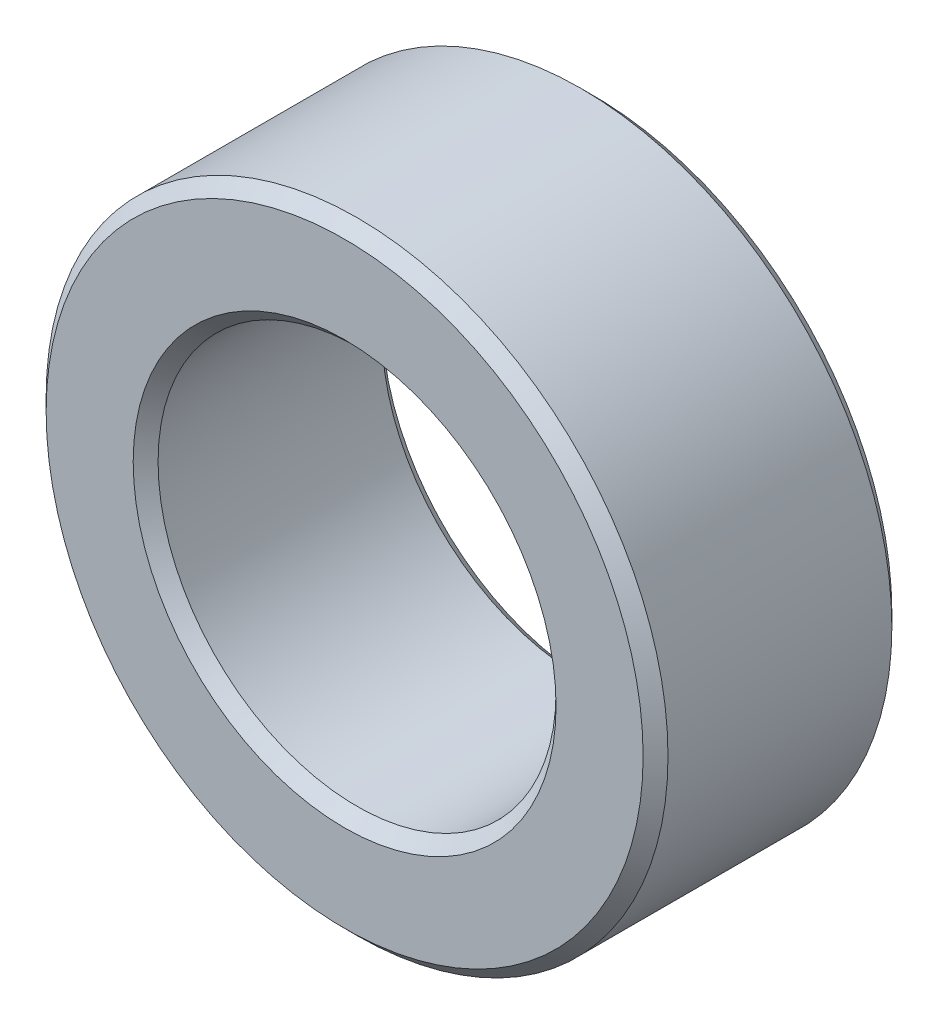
from build123d import *

# Parameters (mm, degrees)
SKETCH1_R           = 5
SKETCH1_R_2         = 3.2
BOSS_EXTRUDE2_DEPTH = 2
CHAMFER3_SIZE       = 0.2


with BuildPart() as part:
    # Sketch1 → Boss-Extrude2 (new, symmetric)
    with BuildSketch(Plane.XY):
        Circle(SKETCH1_R)
        Circle(SKETCH1_R_2, mode=Mode.SUBTRACT)
    extrude(amount=BOSS_EXTRUDE2_DEPTH, both=True)

    # Chamfer3
    chamfer3_edges = [part.edges().sort_by_distance(p)[0] for p in [
        (-5, 0, -2),
        (-5, 0, 2),
        (-3.2, 0, -2),
        (-3.2, 0, 2),
    ]]
    chamfer(chamfer3_edges, length=CHAMFER3_SIZE)


solid = part.part
